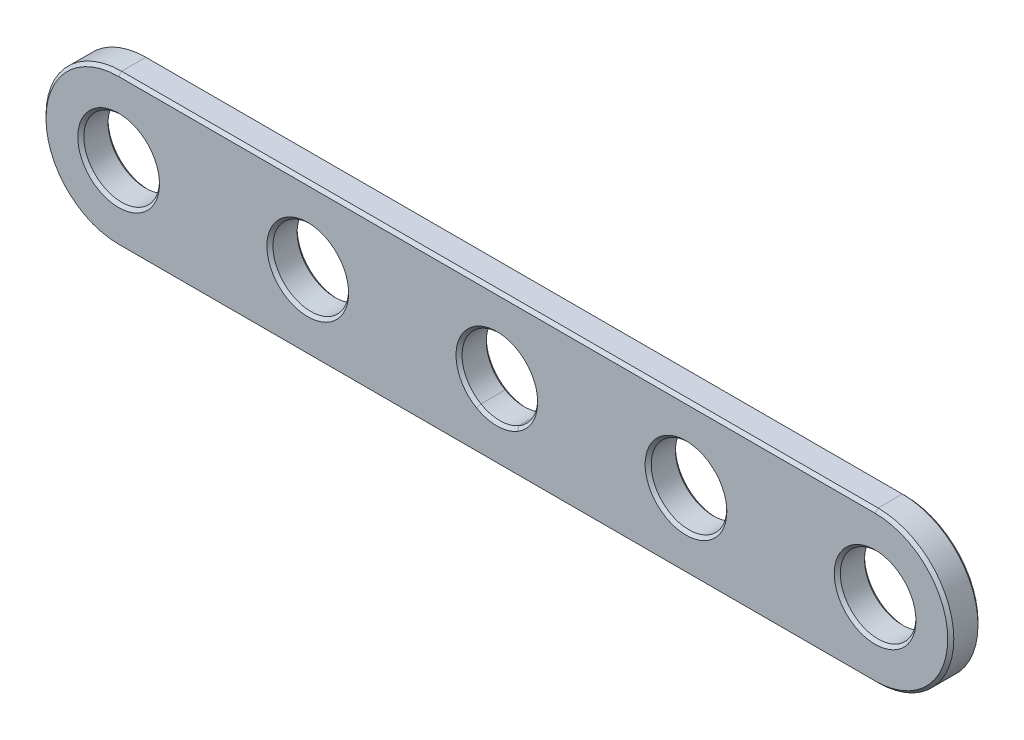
ISO-10303-21;
HEADER;
FILE_DESCRIPTION(('STEP AP214'),'2;1');
FILE_NAME('part.step','',(''),(''),'','','');
FILE_SCHEMA(('AUTOMOTIVE_DESIGN { 1 0 10303 214 1 1 1 1 }'));
ENDSEC;
DATA;
#1=APPLICATION_CONTEXT('core data for automotive mechanical design processes');
#2=APPLICATION_PROTOCOL_DEFINITION('international standard','automotive_design',2000,#1);
#3=PRODUCT_CONTEXT('',#1,'mechanical');
#4=PRODUCT('Part','Part','',(#3));
#5=PRODUCT_RELATED_PRODUCT_CATEGORY('part','',(#4));
#6=PRODUCT_DEFINITION_FORMATION('','',#4);
#7=PRODUCT_DEFINITION_CONTEXT('part definition',#1,'design');
#8=PRODUCT_DEFINITION('design','',#6,#7);
#9=PRODUCT_DEFINITION_SHAPE('','',#8);
#10=(LENGTH_UNIT() NAMED_UNIT(*) SI_UNIT(.MILLI.,.METRE.));
#11=(NAMED_UNIT(*) PLANE_ANGLE_UNIT() SI_UNIT($,.RADIAN.));
#12=(NAMED_UNIT(*) SI_UNIT($,.STERADIAN.) SOLID_ANGLE_UNIT());
#13=UNCERTAINTY_MEASURE_WITH_UNIT(LENGTH_MEASURE(1.E-05),#10,'distance_accuracy_value','');
#14=(GEOMETRIC_REPRESENTATION_CONTEXT(3) GLOBAL_UNCERTAINTY_ASSIGNED_CONTEXT((#13)) GLOBAL_UNIT_ASSIGNED_CONTEXT((#10,
#11,#12)) REPRESENTATION_CONTEXT('',''));
#15=CARTESIAN_POINT('',(0.,0.,0.));
#16=DIRECTION('',(0.,0.,1.));
#17=DIRECTION('',(1.,0.,0.));
#18=AXIS2_PLACEMENT_3D('',#15,#16,#17);
#19=CARTESIAN_POINT('',(250.,50.,0.));
#20=DIRECTION('',(0.,0.,1.));
#21=DIRECTION('',(1.,0.,0.));
#22=AXIS2_PLACEMENT_3D('',#19,#20,#21);
#23=CYLINDRICAL_SURFACE('',#22,25.);
#24=DIRECTION('',(0.,0.,1.));
#25=VECTOR('',#24,1.);
#26=CARTESIAN_POINT('',(262.5,28.349364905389,0.));
#27=LINE('',#26,#25);
#28=CARTESIAN_POINT('',(262.5,28.349364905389,18.0000000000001));
#29=VERTEX_POINT('',#28);
#30=CARTESIAN_POINT('',(262.5,28.349364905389,1.99999999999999));
#31=VERTEX_POINT('',#30);
#32=EDGE_CURVE('E185',#29,#31,#27,.F.);
#33=ORIENTED_EDGE('',*,*,#32,.F.);
#34=CARTESIAN_POINT('',(250.,50.,18.0000000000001));
#35=DIRECTION('',(0.,0.,1.));
#36=DIRECTION('',(1.,0.,0.));
#37=AXIS2_PLACEMENT_3D('',#34,#35,#36);
#38=CIRCLE('',#37,25.);
#39=CARTESIAN_POINT('',(262.5,71.650635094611,18.0000000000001));
#40=VERTEX_POINT('',#39);
#41=EDGE_CURVE('E172',#29,#40,#38,.T.);
#42=ORIENTED_EDGE('',*,*,#41,.T.);
#43=DIRECTION('',(0.,0.,1.));
#44=VECTOR('',#43,1.);
#45=CARTESIAN_POINT('',(262.5,71.650635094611,0.));
#46=LINE('',#45,#44);
#47=CARTESIAN_POINT('',(262.5,71.650635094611,1.99999999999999));
#48=VERTEX_POINT('',#47);
#49=EDGE_CURVE('E180',#48,#40,#46,.T.);
#50=ORIENTED_EDGE('',*,*,#49,.F.);
#51=CARTESIAN_POINT('',(250.,50.,1.99999999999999));
#52=DIRECTION('',(0.,0.,1.));
#53=DIRECTION('',(1.,0.,0.));
#54=AXIS2_PLACEMENT_3D('',#51,#52,#53);
#55=CIRCLE('',#54,25.);
#56=EDGE_CURVE('E164',#48,#31,#55,.F.);
#57=ORIENTED_EDGE('',*,*,#56,.T.);
#58=EDGE_LOOP('',(#33,#42,#50,#57));
#59=FACE_BOUND('',#58,.T.);
#60=ADVANCED_FACE('F34',(#59),#23,.F.);
#61=DIRECTION('',(0.,0.,1.));
#62=VECTOR('',#61,1.);
#63=CARTESIAN_POINT('',(237.5,28.349364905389,0.));
#64=LINE('',#63,#62);
#65=CARTESIAN_POINT('',(237.5,28.349364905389,1.99999999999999));
#66=VERTEX_POINT('',#65);
#67=CARTESIAN_POINT('',(237.5,28.349364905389,18.0000000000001));
#68=VERTEX_POINT('',#67);
#69=EDGE_CURVE('E195',#66,#68,#64,.T.);
#70=ORIENTED_EDGE('',*,*,#69,.T.);
#71=CARTESIAN_POINT('',(250.,50.,18.0000000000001));
#72=DIRECTION('',(0.,0.,1.));
#73=DIRECTION('',(1.,0.,0.));
#74=AXIS2_PLACEMENT_3D('',#71,#72,#73);
#75=CIRCLE('',#74,25.);
#76=EDGE_CURVE('E232',#68,#29,#75,.T.);
#77=ORIENTED_EDGE('',*,*,#76,.T.);
#78=ORIENTED_EDGE('',*,*,#32,.T.);
#79=CARTESIAN_POINT('',(250.,50.,1.99999999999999));
#80=DIRECTION('',(0.,0.,1.));
#81=DIRECTION('',(1.,0.,0.));
#82=AXIS2_PLACEMENT_3D('',#79,#80,#81);
#83=CIRCLE('',#82,25.);
#84=EDGE_CURVE('E230',#31,#66,#83,.F.);
#85=ORIENTED_EDGE('',*,*,#84,.T.);
#86=EDGE_LOOP('',(#70,#77,#78,#85));
#87=FACE_BOUND('',#86,.T.);
#88=ADVANCED_FACE('F369',(#87),#23,.F.);
#89=DIRECTION('',(0.,0.,1.));
#90=VECTOR('',#89,1.);
#91=CARTESIAN_POINT('',(237.5,71.650635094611,0.));
#92=LINE('',#91,#90);
#93=CARTESIAN_POINT('',(237.5,71.650635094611,18.0000000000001));
#94=VERTEX_POINT('',#93);
#95=CARTESIAN_POINT('',(237.5,71.650635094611,1.99999999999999));
#96=VERTEX_POINT('',#95);
#97=EDGE_CURVE('E183',#94,#96,#92,.F.);
#98=ORIENTED_EDGE('',*,*,#97,.F.);
#99=CARTESIAN_POINT('',(250.,50.,18.0000000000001));
#100=DIRECTION('',(0.,0.,1.));
#101=DIRECTION('',(1.,0.,0.));
#102=AXIS2_PLACEMENT_3D('',#99,#100,#101);
#103=CIRCLE('',#102,25.);
#104=EDGE_CURVE('E236',#94,#68,#103,.T.);
#105=ORIENTED_EDGE('',*,*,#104,.T.);
#106=ORIENTED_EDGE('',*,*,#69,.F.);
#107=CARTESIAN_POINT('',(250.,50.,1.99999999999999));
#108=DIRECTION('',(0.,0.,1.));
#109=DIRECTION('',(1.,0.,0.));
#110=AXIS2_PLACEMENT_3D('',#107,#108,#109);
#111=CIRCLE('',#110,25.);
#112=EDGE_CURVE('E234',#66,#96,#111,.F.);
#113=ORIENTED_EDGE('',*,*,#112,.T.);
#114=EDGE_LOOP('',(#98,#105,#106,#113));
#115=FACE_BOUND('',#114,.T.);
#116=ADVANCED_FACE('F407',(#115),#23,.F.);
#117=CARTESIAN_POINT('',(0.,50.,20.));
#118=DIRECTION('',(0.,0.,-1.));
#119=DIRECTION('',(-1.,0.,0.));
#120=AXIS2_PLACEMENT_3D('',#117,#118,#119);
#121=CYLINDRICAL_SURFACE('',#120,50.);
#122=DIRECTION('',(0.,0.,-1.));
#123=VECTOR('',#122,1.);
#124=CARTESIAN_POINT('',(0.,100.,20.));
#125=LINE('',#124,#123);
#126=CARTESIAN_POINT('',(0.,100.,18.0000000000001));
#127=VERTEX_POINT('',#126);
#128=CARTESIAN_POINT('',(0.,100.,1.99999999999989));
#129=VERTEX_POINT('',#128);
#130=EDGE_CURVE('E314',#127,#129,#125,.T.);
#131=ORIENTED_EDGE('',*,*,#130,.T.);
#132=CARTESIAN_POINT('',(0.,50.,1.99999999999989));
#133=DIRECTION('',(0.,0.,1.));
#134=DIRECTION('',(1.,0.,0.));
#135=AXIS2_PLACEMENT_3D('',#132,#133,#134);
#136=CIRCLE('',#135,50.);
#137=CARTESIAN_POINT('',(0.,0.,1.99999999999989));
#138=VERTEX_POINT('',#137);
#139=EDGE_CURVE('E301',#129,#138,#136,.T.);
#140=ORIENTED_EDGE('',*,*,#139,.T.);
#141=DIRECTION('',(0.,0.,-1.));
#142=VECTOR('',#141,1.);
#143=CARTESIAN_POINT('',(0.,0.,20.));
#144=LINE('',#143,#142);
#145=CARTESIAN_POINT('',(0.,0.,18.0000000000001));
#146=VERTEX_POINT('',#145);
#147=EDGE_CURVE('E357',#146,#138,#144,.T.);
#148=ORIENTED_EDGE('',*,*,#147,.F.);
#149=CARTESIAN_POINT('',(0.,50.,18.0000000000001));
#150=DIRECTION('',(0.,0.,1.));
#151=DIRECTION('',(1.,0.,0.));
#152=AXIS2_PLACEMENT_3D('',#149,#150,#151);
#153=CIRCLE('',#152,50.);
#154=EDGE_CURVE('E56',#146,#127,#153,.F.);
#155=ORIENTED_EDGE('',*,*,#154,.T.);
#156=EDGE_LOOP('',(#131,#140,#148,#155));
#157=FACE_BOUND('',#156,.T.);
#158=ADVANCED_FACE('F421',(#157),#121,.T.);
#159=CARTESIAN_POINT('',(0.,0.,20.));
#160=DIRECTION('',(0.,1.,0.));
#161=DIRECTION('',(0.,0.,1.));
#162=AXIS2_PLACEMENT_3D('',#159,#160,#161);
#163=PLANE('',#162);
#164=ORIENTED_EDGE('',*,*,#147,.T.);
#165=DIRECTION('',(1.,0.,0.));
#166=VECTOR('',#165,1.);
#167=CARTESIAN_POINT('',(0.,0.,1.99999999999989));
#168=LINE('',#167,#166);
#169=CARTESIAN_POINT('',(500.,0.,1.99999999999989));
#170=VERTEX_POINT('',#169);
#171=EDGE_CURVE('E293',#138,#170,#168,.T.);
#172=ORIENTED_EDGE('',*,*,#171,.T.);
#173=DIRECTION('',(0.,0.,-1.));
#174=VECTOR('',#173,1.);
#175=CARTESIAN_POINT('',(500.,0.,20.));
#176=LINE('',#175,#174);
#177=CARTESIAN_POINT('',(500.,0.,18.0000000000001));
#178=VERTEX_POINT('',#177);
#179=EDGE_CURVE('E355',#178,#170,#176,.T.);
#180=ORIENTED_EDGE('',*,*,#179,.F.);
#181=DIRECTION('',(-1.,0.,0.));
#182=VECTOR('',#181,1.);
#183=CARTESIAN_POINT('',(0.,0.,18.0000000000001));
#184=LINE('',#183,#182);
#185=EDGE_CURVE('E290',#178,#146,#184,.T.);
#186=ORIENTED_EDGE('',*,*,#185,.T.);
#187=EDGE_LOOP('',(#164,#172,#180,#186));
#188=FACE_BOUND('',#187,.T.);
#189=ADVANCED_FACE('F425',(#188),#163,.F.);
#190=CARTESIAN_POINT('',(500.,50.,20.));
#191=DIRECTION('',(0.,0.,-1.));
#192=DIRECTION('',(-1.,0.,0.));
#193=AXIS2_PLACEMENT_3D('',#190,#191,#192);
#194=CYLINDRICAL_SURFACE('',#193,50.);
#195=ORIENTED_EDGE('',*,*,#179,.T.);
#196=CARTESIAN_POINT('',(500.,50.,1.99999999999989));
#197=DIRECTION('',(0.,0.,1.));
#198=DIRECTION('',(1.,0.,0.));
#199=AXIS2_PLACEMENT_3D('',#196,#197,#198);
#200=CIRCLE('',#199,50.);
#201=CARTESIAN_POINT('',(500.,100.,1.99999999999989));
#202=VERTEX_POINT('',#201);
#203=EDGE_CURVE('E298',#170,#202,#200,.T.);
#204=ORIENTED_EDGE('',*,*,#203,.T.);
#205=DIRECTION('',(0.,0.,-1.));
#206=VECTOR('',#205,1.);
#207=CARTESIAN_POINT('',(500.,100.,20.));
#208=LINE('',#207,#206);
#209=CARTESIAN_POINT('',(500.,100.,18.0000000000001));
#210=VERTEX_POINT('',#209);
#211=EDGE_CURVE('E349',#210,#202,#208,.T.);
#212=ORIENTED_EDGE('',*,*,#211,.F.);
#213=CARTESIAN_POINT('',(500.,50.,18.0000000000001));
#214=DIRECTION('',(0.,0.,1.));
#215=DIRECTION('',(1.,0.,0.));
#216=AXIS2_PLACEMENT_3D('',#213,#214,#215);
#217=CIRCLE('',#216,50.);
#218=EDGE_CURVE('E296',#210,#178,#217,.F.);
#219=ORIENTED_EDGE('',*,*,#218,.T.);
#220=EDGE_LOOP('',(#195,#204,#212,#219));
#221=FACE_BOUND('',#220,.T.);
#222=ADVANCED_FACE('F352',(#221),#194,.T.);
#223=CARTESIAN_POINT('',(0.,100.,20.));
#224=DIRECTION('',(0.,-1.,0.));
#225=DIRECTION('',(0.,0.,-1.));
#226=AXIS2_PLACEMENT_3D('',#223,#224,#225);
#227=PLANE('',#226);
#228=ORIENTED_EDGE('',*,*,#211,.T.);
#229=DIRECTION('',(-1.,0.,0.));
#230=VECTOR('',#229,1.);
#231=CARTESIAN_POINT('',(0.,100.,1.99999999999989));
#232=LINE('',#231,#230);
#233=EDGE_CURVE('E11',#202,#129,#232,.T.);
#234=ORIENTED_EDGE('',*,*,#233,.T.);
#235=ORIENTED_EDGE('',*,*,#130,.F.);
#236=DIRECTION('',(1.,0.,0.));
#237=VECTOR('',#236,1.);
#238=CARTESIAN_POINT('',(500.,100.,18.0000000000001));
#239=LINE('',#238,#237);
#240=EDGE_CURVE('E43',#127,#210,#239,.T.);
#241=ORIENTED_EDGE('',*,*,#240,.T.);
#242=EDGE_LOOP('',(#228,#234,#235,#241));
#243=FACE_BOUND('',#242,.T.);
#244=ADVANCED_FACE('F348',(#243),#227,.F.);
#245=CARTESIAN_POINT('',(0.,50.,20.));
#246=DIRECTION('',(0.,0.,1.));
#247=DIRECTION('',(1.,0.,0.));
#248=AXIS2_PLACEMENT_3D('',#245,#246,#247);
#249=PLANE('',#248);
#250=CARTESIAN_POINT('',(250.,50.,20.));
#251=DIRECTION('',(0.,0.,1.));
#252=DIRECTION('',(1.,0.,0.));
#253=AXIS2_PLACEMENT_3D('',#250,#251,#252);
#254=CIRCLE('',#253,26.9999999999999);
#255=CARTESIAN_POINT('',(236.5,26.6173140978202,20.));
#256=VERTEX_POINT('',#255);
#257=CARTESIAN_POINT('',(236.5,73.3826859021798,20.));
#258=VERTEX_POINT('',#257);
#259=EDGE_CURVE('E221',#256,#258,#254,.F.);
#260=ORIENTED_EDGE('',*,*,#259,.T.);
#261=CARTESIAN_POINT('',(250.,50.,20.));
#262=DIRECTION('',(0.,0.,1.));
#263=DIRECTION('',(1.,0.,0.));
#264=AXIS2_PLACEMENT_3D('',#261,#262,#263);
#265=CIRCLE('',#264,26.9999999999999);
#266=CARTESIAN_POINT('',(263.5,73.3826859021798,20.));
#267=VERTEX_POINT('',#266);
#268=EDGE_CURVE('E173',#258,#267,#265,.F.);
#269=ORIENTED_EDGE('',*,*,#268,.T.);
#270=CARTESIAN_POINT('',(250.,50.,20.));
#271=DIRECTION('',(0.,0.,1.));
#272=DIRECTION('',(1.,0.,0.));
#273=AXIS2_PLACEMENT_3D('',#270,#271,#272);
#274=CIRCLE('',#273,26.9999999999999);
#275=CARTESIAN_POINT('',(263.5,26.6173140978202,20.));
#276=VERTEX_POINT('',#275);
#277=EDGE_CURVE('E225',#267,#276,#274,.F.);
#278=ORIENTED_EDGE('',*,*,#277,.T.);
#279=CARTESIAN_POINT('',(250.,50.,20.));
#280=DIRECTION('',(0.,0.,1.));
#281=DIRECTION('',(1.,0.,0.));
#282=AXIS2_PLACEMENT_3D('',#279,#280,#281);
#283=CIRCLE('',#282,26.9999999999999);
#284=EDGE_CURVE('E223',#276,#256,#283,.F.);
#285=ORIENTED_EDGE('',*,*,#284,.T.);
#286=EDGE_LOOP('',(#260,#269,#278,#285));
#287=FACE_BOUND('',#286,.T.);
#288=CARTESIAN_POINT('',(500.,50.,20.));
#289=DIRECTION('',(0.,0.,1.));
#290=DIRECTION('',(1.,0.,0.));
#291=AXIS2_PLACEMENT_3D('',#288,#289,#290);
#292=CIRCLE('',#291,26.9999999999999);
#293=CARTESIAN_POINT('',(527.,50.,20.));
#294=VERTEX_POINT('',#293);
#295=EDGE_CURVE('E218',#294,#294,#292,.F.);
#296=ORIENTED_EDGE('',*,*,#295,.T.);
#297=EDGE_LOOP('',(#296));
#298=FACE_BOUND('',#297,.T.);
#299=CARTESIAN_POINT('',(375.,50.,20.));
#300=DIRECTION('',(0.,0.,1.));
#301=DIRECTION('',(1.,0.,0.));
#302=AXIS2_PLACEMENT_3D('',#299,#300,#301);
#303=CIRCLE('',#302,26.9999999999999);
#304=CARTESIAN_POINT('',(402.,50.,20.));
#305=VERTEX_POINT('',#304);
#306=EDGE_CURVE('E215',#305,#305,#303,.F.);
#307=ORIENTED_EDGE('',*,*,#306,.T.);
#308=EDGE_LOOP('',(#307));
#309=FACE_BOUND('',#308,.T.);
#310=CARTESIAN_POINT('',(125.,50.,20.));
#311=DIRECTION('',(0.,0.,1.));
#312=DIRECTION('',(1.,0.,0.));
#313=AXIS2_PLACEMENT_3D('',#310,#311,#312);
#314=CIRCLE('',#313,26.9999999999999);
#315=CARTESIAN_POINT('',(152.,50.,20.));
#316=VERTEX_POINT('',#315);
#317=EDGE_CURVE('E212',#316,#316,#314,.F.);
#318=ORIENTED_EDGE('',*,*,#317,.T.);
#319=EDGE_LOOP('',(#318));
#320=FACE_BOUND('',#319,.T.);
#321=CARTESIAN_POINT('',(0.,50.,20.));
#322=DIRECTION('',(0.,0.,1.));
#323=DIRECTION('',(1.,0.,0.));
#324=AXIS2_PLACEMENT_3D('',#321,#322,#323);
#325=CIRCLE('',#324,26.9999999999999);
#326=CARTESIAN_POINT('',(26.9999999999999,50.,20.));
#327=VERTEX_POINT('',#326);
#328=EDGE_CURVE('E209',#327,#327,#325,.F.);
#329=ORIENTED_EDGE('',*,*,#328,.T.);
#330=EDGE_LOOP('',(#329));
#331=FACE_BOUND('',#330,.T.);
#332=CARTESIAN_POINT('',(0.,50.,20.));
#333=DIRECTION('',(0.,0.,1.));
#334=DIRECTION('',(1.,0.,0.));
#335=AXIS2_PLACEMENT_3D('',#332,#333,#334);
#336=CIRCLE('',#335,48.0000000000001);
#337=CARTESIAN_POINT('',(0.,98.0000000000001,20.));
#338=VERTEX_POINT('',#337);
#339=CARTESIAN_POINT('',(0.,1.99999999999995,20.));
#340=VERTEX_POINT('',#339);
#341=EDGE_CURVE('E202',#338,#340,#336,.T.);
#342=ORIENTED_EDGE('',*,*,#341,.T.);
#343=DIRECTION('',(1.,0.,0.));
#344=VECTOR('',#343,1.);
#345=CARTESIAN_POINT('',(500.,1.99999999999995,20.));
#346=LINE('',#345,#344);
#347=CARTESIAN_POINT('',(500.,1.99999999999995,20.));
#348=VERTEX_POINT('',#347);
#349=EDGE_CURVE('E206',#340,#348,#346,.T.);
#350=ORIENTED_EDGE('',*,*,#349,.T.);
#351=CARTESIAN_POINT('',(500.,50.,20.));
#352=DIRECTION('',(0.,0.,1.));
#353=DIRECTION('',(1.,0.,0.));
#354=AXIS2_PLACEMENT_3D('',#351,#352,#353);
#355=CIRCLE('',#354,48.0000000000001);
#356=CARTESIAN_POINT('',(500.,98.0000000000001,20.));
#357=VERTEX_POINT('',#356);
#358=EDGE_CURVE('E204',#348,#357,#355,.T.);
#359=ORIENTED_EDGE('',*,*,#358,.T.);
#360=DIRECTION('',(-1.,0.,0.));
#361=VECTOR('',#360,1.);
#362=CARTESIAN_POINT('',(0.,98.0000000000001,20.));
#363=LINE('',#362,#361);
#364=EDGE_CURVE('E200',#357,#338,#363,.T.);
#365=ORIENTED_EDGE('',*,*,#364,.T.);
#366=EDGE_LOOP('',(#342,#350,#359,#365));
#367=FACE_BOUND('',#366,.T.);
#368=ADVANCED_FACE('F385',(#287,#298,#309,#320,#331,#367),#249,.T.);
#369=CARTESIAN_POINT('',(0.,50.,0.));
#370=DIRECTION('',(0.,0.,1.));
#371=DIRECTION('',(1.,0.,0.));
#372=AXIS2_PLACEMENT_3D('',#369,#370,#371);
#373=PLANE('',#372);
#374=CARTESIAN_POINT('',(250.,50.,0.));
#375=DIRECTION('',(0.,0.,1.));
#376=DIRECTION('',(1.,0.,0.));
#377=AXIS2_PLACEMENT_3D('',#374,#375,#376);
#378=CIRCLE('',#377,27.);
#379=CARTESIAN_POINT('',(263.5,26.6173140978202,0.));
#380=VERTEX_POINT('',#379);
#381=CARTESIAN_POINT('',(263.5,73.3826859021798,0.));
#382=VERTEX_POINT('',#381);
#383=EDGE_CURVE('E263',#380,#382,#378,.T.);
#384=ORIENTED_EDGE('',*,*,#383,.T.);
#385=CARTESIAN_POINT('',(250.,50.,0.));
#386=DIRECTION('',(0.,0.,1.));
#387=DIRECTION('',(1.,0.,0.));
#388=AXIS2_PLACEMENT_3D('',#385,#386,#387);
#389=CIRCLE('',#388,27.);
#390=CARTESIAN_POINT('',(236.5,73.3826859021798,0.));
#391=VERTEX_POINT('',#390);
#392=EDGE_CURVE('E157',#382,#391,#389,.T.);
#393=ORIENTED_EDGE('',*,*,#392,.T.);
#394=CARTESIAN_POINT('',(250.,50.,0.));
#395=DIRECTION('',(0.,0.,1.));
#396=DIRECTION('',(1.,0.,0.));
#397=AXIS2_PLACEMENT_3D('',#394,#395,#396);
#398=CIRCLE('',#397,27.);
#399=CARTESIAN_POINT('',(236.5,26.6173140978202,0.));
#400=VERTEX_POINT('',#399);
#401=EDGE_CURVE('E259',#391,#400,#398,.T.);
#402=ORIENTED_EDGE('',*,*,#401,.T.);
#403=CARTESIAN_POINT('',(250.,50.,0.));
#404=DIRECTION('',(0.,0.,1.));
#405=DIRECTION('',(1.,0.,0.));
#406=AXIS2_PLACEMENT_3D('',#403,#404,#405);
#407=CIRCLE('',#406,27.);
#408=EDGE_CURVE('E261',#400,#380,#407,.T.);
#409=ORIENTED_EDGE('',*,*,#408,.T.);
#410=EDGE_LOOP('',(#384,#393,#402,#409));
#411=FACE_BOUND('',#410,.T.);
#412=CARTESIAN_POINT('',(500.,50.,0.));
#413=DIRECTION('',(0.,0.,1.));
#414=DIRECTION('',(1.,0.,0.));
#415=AXIS2_PLACEMENT_3D('',#412,#413,#414);
#416=CIRCLE('',#415,26.9999999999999);
#417=CARTESIAN_POINT('',(527.,50.,0.));
#418=VERTEX_POINT('',#417);
#419=EDGE_CURVE('E256',#418,#418,#416,.T.);
#420=ORIENTED_EDGE('',*,*,#419,.T.);
#421=EDGE_LOOP('',(#420));
#422=FACE_BOUND('',#421,.T.);
#423=CARTESIAN_POINT('',(375.,50.,0.));
#424=DIRECTION('',(0.,0.,1.));
#425=DIRECTION('',(1.,0.,0.));
#426=AXIS2_PLACEMENT_3D('',#423,#424,#425);
#427=CIRCLE('',#426,26.9999999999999);
#428=CARTESIAN_POINT('',(402.,50.,0.));
#429=VERTEX_POINT('',#428);
#430=EDGE_CURVE('E253',#429,#429,#427,.T.);
#431=ORIENTED_EDGE('',*,*,#430,.T.);
#432=EDGE_LOOP('',(#431));
#433=FACE_BOUND('',#432,.T.);
#434=CARTESIAN_POINT('',(125.,50.,0.));
#435=DIRECTION('',(0.,0.,1.));
#436=DIRECTION('',(1.,0.,0.));
#437=AXIS2_PLACEMENT_3D('',#434,#435,#436);
#438=CIRCLE('',#437,27.);
#439=CARTESIAN_POINT('',(152.,50.,0.));
#440=VERTEX_POINT('',#439);
#441=EDGE_CURVE('E250',#440,#440,#438,.T.);
#442=ORIENTED_EDGE('',*,*,#441,.T.);
#443=EDGE_LOOP('',(#442));
#444=FACE_BOUND('',#443,.T.);
#445=CARTESIAN_POINT('',(0.,50.,0.));
#446=DIRECTION('',(0.,0.,1.));
#447=DIRECTION('',(1.,0.,0.));
#448=AXIS2_PLACEMENT_3D('',#445,#446,#447);
#449=CIRCLE('',#448,27.0000000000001);
#450=CARTESIAN_POINT('',(27.0000000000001,50.,0.));
#451=VERTEX_POINT('',#450);
#452=EDGE_CURVE('E247',#451,#451,#449,.T.);
#453=ORIENTED_EDGE('',*,*,#452,.T.);
#454=EDGE_LOOP('',(#453));
#455=FACE_BOUND('',#454,.T.);
#456=CARTESIAN_POINT('',(500.,50.,0.));
#457=DIRECTION('',(0.,0.,1.));
#458=DIRECTION('',(1.,0.,0.));
#459=AXIS2_PLACEMENT_3D('',#456,#457,#458);
#460=CIRCLE('',#459,48.0000000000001);
#461=CARTESIAN_POINT('',(500.,98.0000000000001,0.));
#462=VERTEX_POINT('',#461);
#463=CARTESIAN_POINT('',(500.,1.99999999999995,0.));
#464=VERTEX_POINT('',#463);
#465=EDGE_CURVE('E242',#462,#464,#460,.F.);
#466=ORIENTED_EDGE('',*,*,#465,.T.);
#467=DIRECTION('',(-1.,0.,0.));
#468=VECTOR('',#467,1.);
#469=CARTESIAN_POINT('',(0.,1.99999999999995,0.));
#470=LINE('',#469,#468);
#471=CARTESIAN_POINT('',(0.,1.99999999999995,0.));
#472=VERTEX_POINT('',#471);
#473=EDGE_CURVE('E244',#464,#472,#470,.T.);
#474=ORIENTED_EDGE('',*,*,#473,.T.);
#475=CARTESIAN_POINT('',(0.,50.,0.));
#476=DIRECTION('',(0.,0.,1.));
#477=DIRECTION('',(1.,0.,0.));
#478=AXIS2_PLACEMENT_3D('',#475,#476,#477);
#479=CIRCLE('',#478,48.0000000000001);
#480=CARTESIAN_POINT('',(0.,98.0000000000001,0.));
#481=VERTEX_POINT('',#480);
#482=EDGE_CURVE('E240',#472,#481,#479,.F.);
#483=ORIENTED_EDGE('',*,*,#482,.T.);
#484=DIRECTION('',(1.,0.,0.));
#485=VECTOR('',#484,1.);
#486=CARTESIAN_POINT('',(0.,98.0000000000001,0.));
#487=LINE('',#486,#485);
#488=EDGE_CURVE('E238',#481,#462,#487,.T.);
#489=ORIENTED_EDGE('',*,*,#488,.T.);
#490=EDGE_LOOP('',(#466,#474,#483,#489));
#491=FACE_BOUND('',#490,.T.);
#492=ADVANCED_FACE('F433',(#411,#422,#433,#444,#455,#491),#373,.F.);
#493=CARTESIAN_POINT('',(0.,50.,0.));
#494=DIRECTION('',(0.,0.,1.));
#495=DIRECTION('',(1.,0.,0.));
#496=AXIS2_PLACEMENT_3D('',#493,#494,#495);
#497=CYLINDRICAL_SURFACE('',#496,25.);
#498=CARTESIAN_POINT('',(0.,50.,2.00000000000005));
#499=DIRECTION('',(0.,0.,1.));
#500=DIRECTION('',(1.,0.,0.));
#501=AXIS2_PLACEMENT_3D('',#498,#499,#500);
#502=CIRCLE('',#501,25.);
#503=CARTESIAN_POINT('',(25.,50.,2.00000000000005));
#504=VERTEX_POINT('',#503);
#505=EDGE_CURVE('E287',#504,#504,#502,.F.);
#506=ORIENTED_EDGE('',*,*,#505,.T.);
#507=EDGE_LOOP('',(#506));
#508=FACE_BOUND('',#507,.T.);
#509=CARTESIAN_POINT('',(0.,50.,18.0000000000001));
#510=DIRECTION('',(0.,0.,1.));
#511=DIRECTION('',(1.,0.,0.));
#512=AXIS2_PLACEMENT_3D('',#509,#510,#511);
#513=CIRCLE('',#512,25.);
#514=CARTESIAN_POINT('',(25.,50.,18.0000000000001));
#515=VERTEX_POINT('',#514);
#516=EDGE_CURVE('E284',#515,#515,#513,.T.);
#517=ORIENTED_EDGE('',*,*,#516,.T.);
#518=EDGE_LOOP('',(#517));
#519=FACE_BOUND('',#518,.T.);
#520=ADVANCED_FACE('F418',(#508,#519),#497,.F.);
#521=CARTESIAN_POINT('',(125.,50.,0.));
#522=DIRECTION('',(0.,0.,1.));
#523=DIRECTION('',(1.,0.,0.));
#524=AXIS2_PLACEMENT_3D('',#521,#522,#523);
#525=CYLINDRICAL_SURFACE('',#524,25.);
#526=CARTESIAN_POINT('',(125.,50.,1.99999999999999));
#527=DIRECTION('',(0.,0.,1.));
#528=DIRECTION('',(1.,0.,0.));
#529=AXIS2_PLACEMENT_3D('',#526,#527,#528);
#530=CIRCLE('',#529,25.);
#531=CARTESIAN_POINT('',(150.,50.,1.99999999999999));
#532=VERTEX_POINT('',#531);
#533=EDGE_CURVE('E281',#532,#532,#530,.F.);
#534=ORIENTED_EDGE('',*,*,#533,.T.);
#535=EDGE_LOOP('',(#534));
#536=FACE_BOUND('',#535,.T.);
#537=CARTESIAN_POINT('',(125.,50.,18.0000000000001));
#538=DIRECTION('',(0.,0.,1.));
#539=DIRECTION('',(1.,0.,0.));
#540=AXIS2_PLACEMENT_3D('',#537,#538,#539);
#541=CIRCLE('',#540,25.);
#542=CARTESIAN_POINT('',(150.,50.,18.0000000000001));
#543=VERTEX_POINT('',#542);
#544=EDGE_CURVE('E278',#543,#543,#541,.T.);
#545=ORIENTED_EDGE('',*,*,#544,.T.);
#546=EDGE_LOOP('',(#545));
#547=FACE_BOUND('',#546,.T.);
#548=ADVANCED_FACE('F412',(#536,#547),#525,.F.);
#549=ORIENTED_EDGE('',*,*,#49,.T.);
#550=CARTESIAN_POINT('',(250.,50.,18.0000000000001));
#551=DIRECTION('',(0.,0.,1.));
#552=DIRECTION('',(1.,0.,0.));
#553=AXIS2_PLACEMENT_3D('',#550,#551,#552);
#554=CIRCLE('',#553,25.);
#555=EDGE_CURVE('E184',#40,#94,#554,.T.);
#556=ORIENTED_EDGE('',*,*,#555,.T.);
#557=ORIENTED_EDGE('',*,*,#97,.T.);
#558=CARTESIAN_POINT('',(250.,50.,1.99999999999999));
#559=DIRECTION('',(0.,0.,1.));
#560=DIRECTION('',(1.,0.,0.));
#561=AXIS2_PLACEMENT_3D('',#558,#559,#560);
#562=CIRCLE('',#561,25.);
#563=EDGE_CURVE('E154',#96,#48,#562,.F.);
#564=ORIENTED_EDGE('',*,*,#563,.T.);
#565=EDGE_LOOP('',(#549,#556,#557,#564));
#566=FACE_BOUND('',#565,.T.);
#567=ADVANCED_FACE('F178',(#566),#23,.F.);
#568=CARTESIAN_POINT('',(375.,50.,0.));
#569=DIRECTION('',(0.,0.,1.));
#570=DIRECTION('',(1.,0.,0.));
#571=AXIS2_PLACEMENT_3D('',#568,#569,#570);
#572=CYLINDRICAL_SURFACE('',#571,25.);
#573=CARTESIAN_POINT('',(375.,50.,18.0000000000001));
#574=DIRECTION('',(0.,0.,1.));
#575=DIRECTION('',(1.,0.,0.));
#576=AXIS2_PLACEMENT_3D('',#573,#574,#575);
#577=CIRCLE('',#576,25.);
#578=CARTESIAN_POINT('',(400.,50.,18.0000000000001));
#579=VERTEX_POINT('',#578);
#580=EDGE_CURVE('E275',#579,#579,#577,.T.);
#581=ORIENTED_EDGE('',*,*,#580,.T.);
#582=EDGE_LOOP('',(#581));
#583=FACE_BOUND('',#582,.T.);
#584=CARTESIAN_POINT('',(375.,50.,1.99999999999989));
#585=DIRECTION('',(0.,0.,1.));
#586=DIRECTION('',(1.,0.,0.));
#587=AXIS2_PLACEMENT_3D('',#584,#585,#586);
#588=CIRCLE('',#587,25.);
#589=CARTESIAN_POINT('',(400.,50.,1.99999999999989));
#590=VERTEX_POINT('',#589);
#591=EDGE_CURVE('E272',#590,#590,#588,.F.);
#592=ORIENTED_EDGE('',*,*,#591,.T.);
#593=EDGE_LOOP('',(#592));
#594=FACE_BOUND('',#593,.T.);
#595=ADVANCED_FACE('F411',(#583,#594),#572,.F.);
#596=CARTESIAN_POINT('',(500.,50.,0.));
#597=DIRECTION('',(0.,0.,1.));
#598=DIRECTION('',(1.,0.,0.));
#599=AXIS2_PLACEMENT_3D('',#596,#597,#598);
#600=CYLINDRICAL_SURFACE('',#599,25.);
#601=CARTESIAN_POINT('',(500.,50.,1.99999999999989));
#602=DIRECTION('',(0.,0.,1.));
#603=DIRECTION('',(1.,0.,0.));
#604=AXIS2_PLACEMENT_3D('',#601,#602,#603);
#605=CIRCLE('',#604,25.);
#606=CARTESIAN_POINT('',(525.,50.,1.99999999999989));
#607=VERTEX_POINT('',#606);
#608=EDGE_CURVE('E269',#607,#607,#605,.F.);
#609=ORIENTED_EDGE('',*,*,#608,.T.);
#610=EDGE_LOOP('',(#609));
#611=FACE_BOUND('',#610,.T.);
#612=CARTESIAN_POINT('',(500.,50.,18.0000000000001));
#613=DIRECTION('',(0.,0.,1.));
#614=DIRECTION('',(1.,0.,0.));
#615=AXIS2_PLACEMENT_3D('',#612,#613,#614);
#616=CIRCLE('',#615,25.);
#617=CARTESIAN_POINT('',(525.,50.,18.0000000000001));
#618=VERTEX_POINT('',#617);
#619=EDGE_CURVE('E266',#618,#618,#616,.T.);
#620=ORIENTED_EDGE('',*,*,#619,.T.);
#621=EDGE_LOOP('',(#620));
#622=FACE_BOUND('',#621,.T.);
#623=ADVANCED_FACE('F400',(#611,#622),#600,.F.);
#624=CARTESIAN_POINT('',(250.,50.,18.0000000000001));
#625=DIRECTION('',(0.,0.,1.));
#626=DIRECTION('',(1.,0.,0.));
#627=AXIS2_PLACEMENT_3D('',#624,#625,#626);
#628=CONICAL_SURFACE('',#627,25.,0.785398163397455);
#629=DIRECTION('',(0.353553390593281,0.612372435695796,-0.707106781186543));
#630=VECTOR('',#629,1.);
#631=CARTESIAN_POINT('',(236.5,26.6173140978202,20.));
#632=LINE('',#631,#630);
#633=EDGE_CURVE('E308',#256,#68,#632,.T.);
#634=ORIENTED_EDGE('',*,*,#633,.F.);
#635=ORIENTED_EDGE('',*,*,#284,.F.);
#636=DIRECTION('',(0.353553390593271,-0.612372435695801,0.707106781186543));
#637=VECTOR('',#636,1.);
#638=CARTESIAN_POINT('',(262.5,28.349364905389,18.0000000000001));
#639=LINE('',#638,#637);
#640=EDGE_CURVE('E311',#29,#276,#639,.T.);
#641=ORIENTED_EDGE('',*,*,#640,.F.);
#642=ORIENTED_EDGE('',*,*,#76,.F.);
#643=EDGE_LOOP('',(#634,#635,#641,#642));
#644=FACE_BOUND('',#643,.T.);
#645=ADVANCED_FACE('F376',(#644),#628,.F.);
#646=CARTESIAN_POINT('',(250.,50.,18.0000000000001));
#647=DIRECTION('',(0.,0.,1.));
#648=DIRECTION('',(1.,0.,0.));
#649=AXIS2_PLACEMENT_3D('',#646,#647,#648);
#650=CONICAL_SURFACE('',#649,25.,0.785398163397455);
#651=ORIENTED_EDGE('',*,*,#640,.T.);
#652=ORIENTED_EDGE('',*,*,#277,.F.);
#653=DIRECTION('',(0.353553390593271,0.612372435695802,0.707106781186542));
#654=VECTOR('',#653,1.);
#655=CARTESIAN_POINT('',(262.5,71.650635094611,18.0000000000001));
#656=LINE('',#655,#654);
#657=EDGE_CURVE('E306',#40,#267,#656,.T.);
#658=ORIENTED_EDGE('',*,*,#657,.F.);
#659=ORIENTED_EDGE('',*,*,#41,.F.);
#660=EDGE_LOOP('',(#651,#652,#658,#659));
#661=FACE_BOUND('',#660,.T.);
#662=ADVANCED_FACE('F392',(#661),#650,.F.);
#663=CARTESIAN_POINT('',(250.,50.,18.0000000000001));
#664=DIRECTION('',(0.,0.,1.));
#665=DIRECTION('',(1.,0.,0.));
#666=AXIS2_PLACEMENT_3D('',#663,#664,#665);
#667=CONICAL_SURFACE('',#666,25.,0.785398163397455);
#668=ORIENTED_EDGE('',*,*,#633,.T.);
#669=ORIENTED_EDGE('',*,*,#104,.F.);
#670=DIRECTION('',(0.353553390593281,-0.612372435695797,-0.707106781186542));
#671=VECTOR('',#670,1.);
#672=CARTESIAN_POINT('',(236.5,73.3826859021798,20.));
#673=LINE('',#672,#671);
#674=EDGE_CURVE('E304',#258,#94,#673,.T.);
#675=ORIENTED_EDGE('',*,*,#674,.F.);
#676=ORIENTED_EDGE('',*,*,#259,.F.);
#677=EDGE_LOOP('',(#668,#669,#675,#676));
#678=FACE_BOUND('',#677,.T.);
#679=ADVANCED_FACE('F381',(#678),#667,.F.);
#680=CARTESIAN_POINT('',(250.,50.,18.0000000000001));
#681=DIRECTION('',(0.,0.,1.));
#682=DIRECTION('',(1.,0.,0.));
#683=AXIS2_PLACEMENT_3D('',#680,#681,#682);
#684=CONICAL_SURFACE('',#683,25.,0.785398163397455);
#685=ORIENTED_EDGE('',*,*,#657,.T.);
#686=ORIENTED_EDGE('',*,*,#268,.F.);
#687=ORIENTED_EDGE('',*,*,#674,.T.);
#688=ORIENTED_EDGE('',*,*,#555,.F.);
#689=EDGE_LOOP('',(#685,#686,#687,#688));
#690=FACE_BOUND('',#689,.T.);
#691=ADVANCED_FACE('F388',(#690),#684,.F.);
#692=CARTESIAN_POINT('',(250.,50.,0.));
#693=DIRECTION('',(0.,0.,-1.));
#694=DIRECTION('',(-1.,0.,0.));
#695=AXIS2_PLACEMENT_3D('',#692,#693,#694);
#696=CONICAL_SURFACE('',#695,27.,0.78539816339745);
#697=DIRECTION('',(-0.353553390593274,-0.612372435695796,-0.707106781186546));
#698=VECTOR('',#697,1.);
#699=CARTESIAN_POINT('',(237.5,28.349364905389,1.99999999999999));
#700=LINE('',#699,#698);
#701=EDGE_CURVE('E160',#66,#400,#700,.T.);
#702=ORIENTED_EDGE('',*,*,#701,.F.);
#703=ORIENTED_EDGE('',*,*,#84,.F.);
#704=DIRECTION('',(-0.353553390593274,0.612372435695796,0.707106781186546));
#705=VECTOR('',#704,1.);
#706=CARTESIAN_POINT('',(263.5,26.6173140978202,0.));
#707=LINE('',#706,#705);
#708=EDGE_CURVE('E167',#380,#31,#707,.T.);
#709=ORIENTED_EDGE('',*,*,#708,.F.);
#710=ORIENTED_EDGE('',*,*,#408,.F.);
#711=EDGE_LOOP('',(#702,#703,#709,#710));
#712=FACE_BOUND('',#711,.T.);
#713=ADVANCED_FACE('F436',(#712),#696,.F.);
#714=CARTESIAN_POINT('',(250.,50.,0.));
#715=DIRECTION('',(0.,0.,-1.));
#716=DIRECTION('',(-1.,0.,0.));
#717=AXIS2_PLACEMENT_3D('',#714,#715,#716);
#718=CONICAL_SURFACE('',#717,27.,0.78539816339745);
#719=ORIENTED_EDGE('',*,*,#708,.T.);
#720=ORIENTED_EDGE('',*,*,#56,.F.);
#721=DIRECTION('',(-0.353553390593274,-0.612372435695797,0.707106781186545));
#722=VECTOR('',#721,1.);
#723=CARTESIAN_POINT('',(263.5,73.3826859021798,0.));
#724=LINE('',#723,#722);
#725=EDGE_CURVE('E150',#382,#48,#724,.T.);
#726=ORIENTED_EDGE('',*,*,#725,.F.);
#727=ORIENTED_EDGE('',*,*,#383,.F.);
#728=EDGE_LOOP('',(#719,#720,#726,#727));
#729=FACE_BOUND('',#728,.T.);
#730=ADVANCED_FACE('F165',(#729),#718,.F.);
#731=CARTESIAN_POINT('',(250.,50.,0.));
#732=DIRECTION('',(0.,0.,-1.));
#733=DIRECTION('',(-1.,0.,0.));
#734=AXIS2_PLACEMENT_3D('',#731,#732,#733);
#735=CONICAL_SURFACE('',#734,27.,0.785398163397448);
#736=ORIENTED_EDGE('',*,*,#701,.T.);
#737=ORIENTED_EDGE('',*,*,#401,.F.);
#738=DIRECTION('',(-0.353553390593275,0.612372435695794,-0.707106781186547));
#739=VECTOR('',#738,1.);
#740=CARTESIAN_POINT('',(237.5,71.650635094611,1.99999999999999));
#741=LINE('',#740,#739);
#742=EDGE_CURVE('E161',#96,#391,#741,.T.);
#743=ORIENTED_EDGE('',*,*,#742,.F.);
#744=ORIENTED_EDGE('',*,*,#112,.F.);
#745=EDGE_LOOP('',(#736,#737,#743,#744));
#746=FACE_BOUND('',#745,.T.);
#747=ADVANCED_FACE('F429',(#746),#735,.F.);
#748=CARTESIAN_POINT('',(250.,50.,0.));
#749=DIRECTION('',(0.,0.,-1.));
#750=DIRECTION('',(-1.,0.,0.));
#751=AXIS2_PLACEMENT_3D('',#748,#749,#750);
#752=CONICAL_SURFACE('',#751,27.,0.785398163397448);
#753=ORIENTED_EDGE('',*,*,#725,.T.);
#754=ORIENTED_EDGE('',*,*,#563,.F.);
#755=ORIENTED_EDGE('',*,*,#742,.T.);
#756=ORIENTED_EDGE('',*,*,#392,.F.);
#757=EDGE_LOOP('',(#753,#754,#755,#756));
#758=FACE_BOUND('',#757,.T.);
#759=ADVANCED_FACE('F152',(#758),#752,.F.);
#760=CARTESIAN_POINT('',(500.,50.,0.));
#761=DIRECTION('',(0.,0.,-1.));
#762=DIRECTION('',(-1.,0.,0.));
#763=AXIS2_PLACEMENT_3D('',#760,#761,#762);
#764=CONICAL_SURFACE('',#763,26.9999999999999,0.785398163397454);
#765=ORIENTED_EDGE('',*,*,#608,.F.);
#766=EDGE_LOOP('',(#765));
#767=FACE_BOUND('',#766,.T.);
#768=ORIENTED_EDGE('',*,*,#419,.F.);
#769=EDGE_LOOP('',(#768));
#770=FACE_BOUND('',#769,.T.);
#771=ADVANCED_FACE('F447',(#767,#770),#764,.F.);
#772=CARTESIAN_POINT('',(500.,50.,18.0000000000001));
#773=DIRECTION('',(0.,0.,1.));
#774=DIRECTION('',(1.,0.,0.));
#775=AXIS2_PLACEMENT_3D('',#772,#773,#774);
#776=CONICAL_SURFACE('',#775,25.,0.785398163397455);
#777=ORIENTED_EDGE('',*,*,#295,.F.);
#778=EDGE_LOOP('',(#777));
#779=FACE_BOUND('',#778,.T.);
#780=ORIENTED_EDGE('',*,*,#619,.F.);
#781=EDGE_LOOP('',(#780));
#782=FACE_BOUND('',#781,.T.);
#783=ADVANCED_FACE('F450',(#779,#782),#776,.F.);
#784=CARTESIAN_POINT('',(375.,50.,18.0000000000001));
#785=DIRECTION('',(0.,0.,1.));
#786=DIRECTION('',(1.,0.,0.));
#787=AXIS2_PLACEMENT_3D('',#784,#785,#786);
#788=CONICAL_SURFACE('',#787,25.,0.785398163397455);
#789=ORIENTED_EDGE('',*,*,#306,.F.);
#790=EDGE_LOOP('',(#789));
#791=FACE_BOUND('',#790,.T.);
#792=ORIENTED_EDGE('',*,*,#580,.F.);
#793=EDGE_LOOP('',(#792));
#794=FACE_BOUND('',#793,.T.);
#795=ADVANCED_FACE('F454',(#791,#794),#788,.F.);
#796=CARTESIAN_POINT('',(375.,50.,0.));
#797=DIRECTION('',(0.,0.,-1.));
#798=DIRECTION('',(-1.,0.,0.));
#799=AXIS2_PLACEMENT_3D('',#796,#797,#798);
#800=CONICAL_SURFACE('',#799,26.9999999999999,0.785398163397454);
#801=ORIENTED_EDGE('',*,*,#591,.F.);
#802=EDGE_LOOP('',(#801));
#803=FACE_BOUND('',#802,.T.);
#804=ORIENTED_EDGE('',*,*,#430,.F.);
#805=EDGE_LOOP('',(#804));
#806=FACE_BOUND('',#805,.T.);
#807=ADVANCED_FACE('F458',(#803,#806),#800,.F.);
#808=CARTESIAN_POINT('',(125.,50.,0.));
#809=DIRECTION('',(0.,0.,-1.));
#810=DIRECTION('',(-1.,0.,0.));
#811=AXIS2_PLACEMENT_3D('',#808,#809,#810);
#812=CONICAL_SURFACE('',#811,27.,0.785398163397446);
#813=ORIENTED_EDGE('',*,*,#533,.F.);
#814=EDGE_LOOP('',(#813));
#815=FACE_BOUND('',#814,.T.);
#816=ORIENTED_EDGE('',*,*,#441,.F.);
#817=EDGE_LOOP('',(#816));
#818=FACE_BOUND('',#817,.T.);
#819=ADVANCED_FACE('F462',(#815,#818),#812,.F.);
#820=CARTESIAN_POINT('',(125.,50.,18.0000000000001));
#821=DIRECTION('',(0.,0.,1.));
#822=DIRECTION('',(1.,0.,0.));
#823=AXIS2_PLACEMENT_3D('',#820,#821,#822);
#824=CONICAL_SURFACE('',#823,25.,0.785398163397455);
#825=ORIENTED_EDGE('',*,*,#317,.F.);
#826=EDGE_LOOP('',(#825));
#827=FACE_BOUND('',#826,.T.);
#828=ORIENTED_EDGE('',*,*,#544,.F.);
#829=EDGE_LOOP('',(#828));
#830=FACE_BOUND('',#829,.T.);
#831=ADVANCED_FACE('F466',(#827,#830),#824,.F.);
#832=CARTESIAN_POINT('',(0.,50.,0.));
#833=DIRECTION('',(0.,0.,-1.));
#834=DIRECTION('',(-1.,0.,0.));
#835=AXIS2_PLACEMENT_3D('',#832,#833,#834);
#836=CONICAL_SURFACE('',#835,27.0000000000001,0.785398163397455);
#837=ORIENTED_EDGE('',*,*,#505,.F.);
#838=EDGE_LOOP('',(#837));
#839=FACE_BOUND('',#838,.T.);
#840=ORIENTED_EDGE('',*,*,#452,.F.);
#841=EDGE_LOOP('',(#840));
#842=FACE_BOUND('',#841,.T.);
#843=ADVANCED_FACE('F470',(#839,#842),#836,.F.);
#844=CARTESIAN_POINT('',(0.,50.,18.0000000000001));
#845=DIRECTION('',(0.,0.,1.));
#846=DIRECTION('',(1.,0.,0.));
#847=AXIS2_PLACEMENT_3D('',#844,#845,#846);
#848=CONICAL_SURFACE('',#847,25.,0.785398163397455);
#849=ORIENTED_EDGE('',*,*,#328,.F.);
#850=EDGE_LOOP('',(#849));
#851=FACE_BOUND('',#850,.T.);
#852=ORIENTED_EDGE('',*,*,#516,.F.);
#853=EDGE_LOOP('',(#852));
#854=FACE_BOUND('',#853,.T.);
#855=ADVANCED_FACE('F474',(#851,#854),#848,.F.);
#856=CARTESIAN_POINT('',(0.,100.,1.99999999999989));
#857=DIRECTION('',(0.,-0.707106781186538,0.707106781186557));
#858=DIRECTION('',(0.,-0.707106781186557,-0.707106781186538));
#859=AXIS2_PLACEMENT_3D('',#856,#857,#858);
#860=PLANE('',#859);
#861=DIRECTION('',(0.,0.707106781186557,0.707106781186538));
#862=VECTOR('',#861,1.);
#863=CARTESIAN_POINT('',(500.,98.0000000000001,0.));
#864=LINE('',#863,#862);
#865=EDGE_CURVE('E324',#462,#202,#864,.T.);
#866=ORIENTED_EDGE('',*,*,#865,.F.);
#867=ORIENTED_EDGE('',*,*,#488,.F.);
#868=DIRECTION('',(0.,-0.707106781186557,-0.707106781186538));
#869=VECTOR('',#868,1.);
#870=CARTESIAN_POINT('',(0.,100.,1.99999999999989));
#871=LINE('',#870,#869);
#872=EDGE_CURVE('E315',#129,#481,#871,.T.);
#873=ORIENTED_EDGE('',*,*,#872,.F.);
#874=ORIENTED_EDGE('',*,*,#233,.F.);
#875=EDGE_LOOP('',(#866,#867,#873,#874));
#876=FACE_BOUND('',#875,.T.);
#877=ADVANCED_FACE('F478',(#876),#860,.F.);
#878=CARTESIAN_POINT('',(0.,50.,1.99999999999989));
#879=DIRECTION('',(0.,0.,1.));
#880=DIRECTION('',(1.,0.,0.));
#881=AXIS2_PLACEMENT_3D('',#878,#879,#880);
#882=CONICAL_SURFACE('',#881,50.,0.785398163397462);
#883=ORIENTED_EDGE('',*,*,#872,.T.);
#884=ORIENTED_EDGE('',*,*,#482,.F.);
#885=DIRECTION('',(0.,0.707106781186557,-0.707106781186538));
#886=VECTOR('',#885,1.);
#887=CARTESIAN_POINT('',(0.,0.,1.99999999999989));
#888=LINE('',#887,#886);
#889=EDGE_CURVE('E322',#138,#472,#888,.T.);
#890=ORIENTED_EDGE('',*,*,#889,.F.);
#891=ORIENTED_EDGE('',*,*,#139,.F.);
#892=EDGE_LOOP('',(#883,#884,#890,#891));
#893=FACE_BOUND('',#892,.T.);
#894=ADVANCED_FACE('F487',(#893),#882,.T.);
#895=CARTESIAN_POINT('',(500.,50.,1.99999999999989));
#896=DIRECTION('',(0.,0.,1.));
#897=DIRECTION('',(1.,0.,0.));
#898=AXIS2_PLACEMENT_3D('',#895,#896,#897);
#899=CONICAL_SURFACE('',#898,50.,0.785398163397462);
#900=ORIENTED_EDGE('',*,*,#865,.T.);
#901=ORIENTED_EDGE('',*,*,#203,.F.);
#902=DIRECTION('',(0.,-0.707106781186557,0.707106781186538));
#903=VECTOR('',#902,1.);
#904=CARTESIAN_POINT('',(500.,1.99999999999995,0.));
#905=LINE('',#904,#903);
#906=EDGE_CURVE('E320',#464,#170,#905,.T.);
#907=ORIENTED_EDGE('',*,*,#906,.F.);
#908=ORIENTED_EDGE('',*,*,#465,.F.);
#909=EDGE_LOOP('',(#900,#901,#907,#908));
#910=FACE_BOUND('',#909,.T.);
#911=ADVANCED_FACE('F483',(#910),#899,.T.);
#912=CARTESIAN_POINT('',(0.,0.,1.99999999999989));
#913=DIRECTION('',(0.,0.707106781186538,0.707106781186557));
#914=DIRECTION('',(0.,-0.707106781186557,0.707106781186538));
#915=AXIS2_PLACEMENT_3D('',#912,#913,#914);
#916=PLANE('',#915);
#917=ORIENTED_EDGE('',*,*,#889,.T.);
#918=ORIENTED_EDGE('',*,*,#473,.F.);
#919=ORIENTED_EDGE('',*,*,#906,.T.);
#920=ORIENTED_EDGE('',*,*,#171,.F.);
#921=EDGE_LOOP('',(#917,#918,#919,#920));
#922=FACE_BOUND('',#921,.T.);
#923=ADVANCED_FACE('F480',(#922),#916,.F.);
#924=CARTESIAN_POINT('',(0.,98.0000000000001,20.));
#925=DIRECTION('',(0.,0.707106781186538,0.707106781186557));
#926=DIRECTION('',(0.,-0.707106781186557,0.707106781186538));
#927=AXIS2_PLACEMENT_3D('',#924,#925,#926);
#928=PLANE('',#927);
#929=DIRECTION('',(0.,-0.707106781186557,0.707106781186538));
#930=VECTOR('',#929,1.);
#931=CARTESIAN_POINT('',(500.,100.,18.0000000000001));
#932=LINE('',#931,#930);
#933=EDGE_CURVE('E332',#210,#357,#932,.T.);
#934=ORIENTED_EDGE('',*,*,#933,.F.);
#935=ORIENTED_EDGE('',*,*,#240,.F.);
#936=DIRECTION('',(0.,0.707106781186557,-0.707106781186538));
#937=VECTOR('',#936,1.);
#938=CARTESIAN_POINT('',(0.,98.0000000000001,20.));
#939=LINE('',#938,#937);
#940=EDGE_CURVE('E38',#338,#127,#939,.T.);
#941=ORIENTED_EDGE('',*,*,#940,.F.);
#942=ORIENTED_EDGE('',*,*,#364,.F.);
#943=EDGE_LOOP('',(#934,#935,#941,#942));
#944=FACE_BOUND('',#943,.T.);
#945=ADVANCED_FACE('F36',(#944),#928,.T.);
#946=CARTESIAN_POINT('',(0.,50.,20.));
#947=DIRECTION('',(0.,0.,-1.));
#948=DIRECTION('',(-1.,0.,0.));
#949=AXIS2_PLACEMENT_3D('',#946,#947,#948);
#950=CONICAL_SURFACE('',#949,48.0000000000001,0.785398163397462);
#951=ORIENTED_EDGE('',*,*,#940,.T.);
#952=ORIENTED_EDGE('',*,*,#154,.F.);
#953=DIRECTION('',(0.,-0.707106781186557,-0.707106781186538));
#954=VECTOR('',#953,1.);
#955=CARTESIAN_POINT('',(0.,1.99999999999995,20.));
#956=LINE('',#955,#954);
#957=EDGE_CURVE('E331',#340,#146,#956,.T.);
#958=ORIENTED_EDGE('',*,*,#957,.F.);
#959=ORIENTED_EDGE('',*,*,#341,.F.);
#960=EDGE_LOOP('',(#951,#952,#958,#959));
#961=FACE_BOUND('',#960,.T.);
#962=ADVANCED_FACE('F342',(#961),#950,.T.);
#963=CARTESIAN_POINT('',(500.,50.,20.));
#964=DIRECTION('',(0.,0.,-1.));
#965=DIRECTION('',(-1.,0.,0.));
#966=AXIS2_PLACEMENT_3D('',#963,#964,#965);
#967=CONICAL_SURFACE('',#966,48.0000000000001,0.785398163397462);
#968=ORIENTED_EDGE('',*,*,#933,.T.);
#969=ORIENTED_EDGE('',*,*,#358,.F.);
#970=DIRECTION('',(0.,0.707106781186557,0.707106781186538));
#971=VECTOR('',#970,1.);
#972=CARTESIAN_POINT('',(500.,0.,18.0000000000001));
#973=LINE('',#972,#971);
#974=EDGE_CURVE('E329',#178,#348,#973,.T.);
#975=ORIENTED_EDGE('',*,*,#974,.F.);
#976=ORIENTED_EDGE('',*,*,#218,.F.);
#977=EDGE_LOOP('',(#968,#969,#975,#976));
#978=FACE_BOUND('',#977,.T.);
#979=ADVANCED_FACE('F498',(#978),#967,.T.);
#980=CARTESIAN_POINT('',(0.,1.99999999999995,20.));
#981=DIRECTION('',(0.,-0.707106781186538,0.707106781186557));
#982=DIRECTION('',(0.,-0.707106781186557,-0.707106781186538));
#983=AXIS2_PLACEMENT_3D('',#980,#981,#982);
#984=PLANE('',#983);
#985=ORIENTED_EDGE('',*,*,#957,.T.);
#986=ORIENTED_EDGE('',*,*,#185,.F.);
#987=ORIENTED_EDGE('',*,*,#974,.T.);
#988=ORIENTED_EDGE('',*,*,#349,.F.);
#989=EDGE_LOOP('',(#985,#986,#987,#988));
#990=FACE_BOUND('',#989,.T.);
#991=ADVANCED_FACE('F495',(#990),#984,.T.);
#992=CLOSED_SHELL('',(#60,#88,#116,#158,#189,#222,#244,#368,#492,#520,#548,#567,#595,#623,#645,
#662,#679,#691,#713,#730,#747,#759,#771,#783,#795,#807,#819,#831,#843,#855,#877,#894,#911,#923,
#945,#962,#979,#991));
#993=MANIFOLD_SOLID_BREP('B2',#992);
#994=ADVANCED_BREP_SHAPE_REPRESENTATION('',(#18,#993),#14);
#995=SHAPE_DEFINITION_REPRESENTATION(#9,#994);
ENDSEC;
END-ISO-10303-21;
